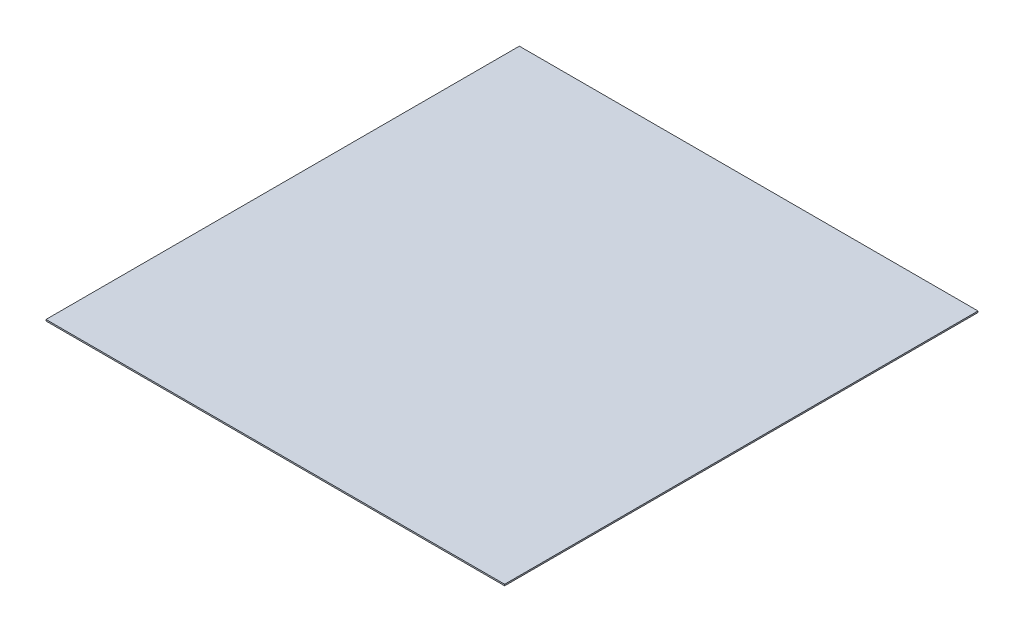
from build123d import *

# Parameters (mm, degrees)
SKETCH1_W           = 164.730847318
SKETCH1_H           = 170.011699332
BOSS_EXTRUDE1_DEPTH = 0.508


with BuildPart() as part:
    # Sketch1 → Boss-Extrude1 (new body)
    with BuildSketch(Plane(origin=(0, 0, 0), x_dir=(1, 0, 0), z_dir=(0, 1, 0))):
        Rectangle(SKETCH1_W, SKETCH1_H)
    extrude(amount=BOSS_EXTRUDE1_DEPTH)


solid = part.part
